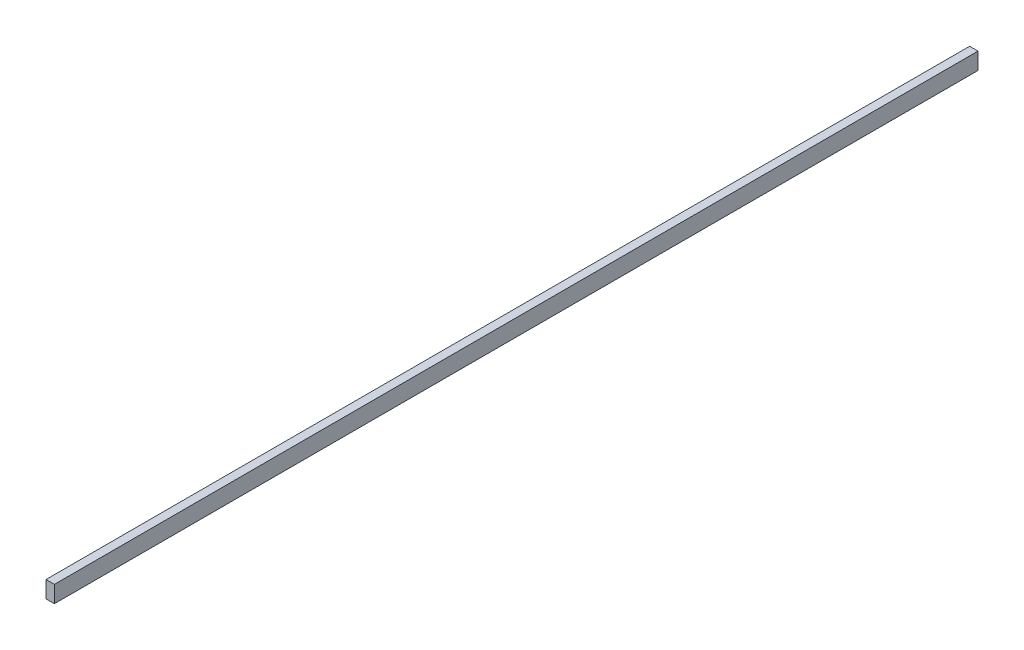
from build123d import *

# Parameters (mm, degrees)
ESQUISSE1_W      = 550
ESQUISSE1_H      = 10
EXTRUSION1_DEPTH = 5


with BuildPart() as part:
    # Esquisse1 → Extrusion1 (new body)
    with BuildSketch(Plane(origin=(0, 0, 0), x_dir=(0, 0, -1), z_dir=(1, 0, 0))):
        with Locations((275, 5)):
            Rectangle(ESQUISSE1_W, ESQUISSE1_H)
    extrude(amount=EXTRUSION1_DEPTH)


solid = part.part
